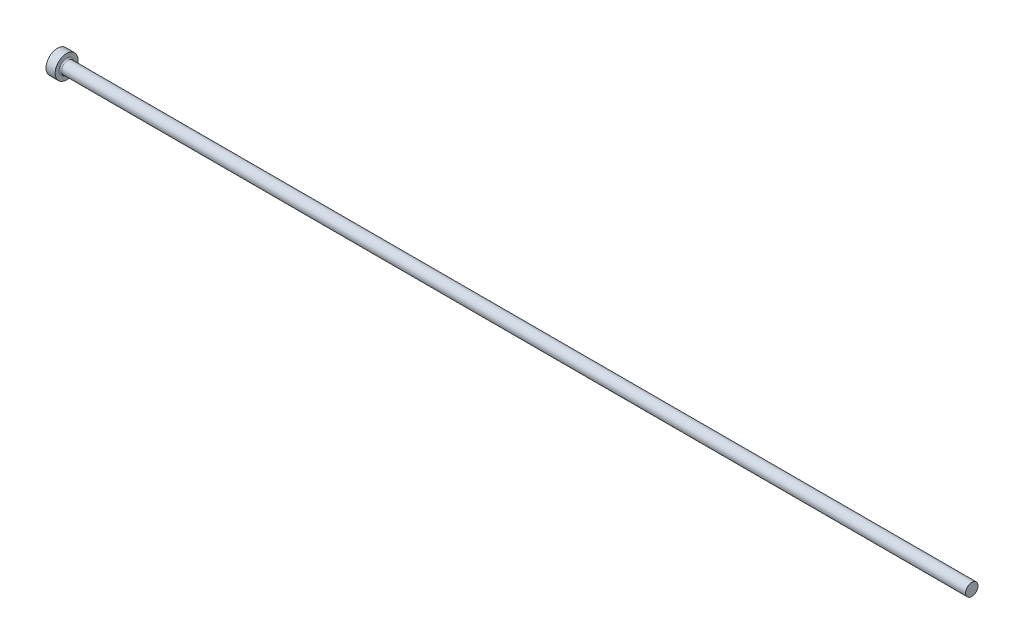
ISO-10303-21;
HEADER;
FILE_DESCRIPTION(('STEP AP214'),'2;1');
FILE_NAME('part.step','',(''),(''),'','','');
FILE_SCHEMA(('AUTOMOTIVE_DESIGN { 1 0 10303 214 1 1 1 1 }'));
ENDSEC;
DATA;
#1=APPLICATION_CONTEXT('core data for automotive mechanical design processes');
#2=APPLICATION_PROTOCOL_DEFINITION('international standard','automotive_design',2000,#1);
#3=PRODUCT_CONTEXT('',#1,'mechanical');
#4=PRODUCT('Part','Part','',(#3));
#5=PRODUCT_RELATED_PRODUCT_CATEGORY('part','',(#4));
#6=PRODUCT_DEFINITION_FORMATION('','',#4);
#7=PRODUCT_DEFINITION_CONTEXT('part definition',#1,'design');
#8=PRODUCT_DEFINITION('design','',#6,#7);
#9=PRODUCT_DEFINITION_SHAPE('','',#8);
#10=(LENGTH_UNIT() NAMED_UNIT(*) SI_UNIT(.MILLI.,.METRE.));
#11=(NAMED_UNIT(*) PLANE_ANGLE_UNIT() SI_UNIT($,.RADIAN.));
#12=(NAMED_UNIT(*) SI_UNIT($,.STERADIAN.) SOLID_ANGLE_UNIT());
#13=UNCERTAINTY_MEASURE_WITH_UNIT(LENGTH_MEASURE(1.E-05),#10,'distance_accuracy_value','');
#14=(GEOMETRIC_REPRESENTATION_CONTEXT(3) GLOBAL_UNCERTAINTY_ASSIGNED_CONTEXT((#13)) GLOBAL_UNIT_ASSIGNED_CONTEXT((#10,
#11,#12)) REPRESENTATION_CONTEXT('',''));
#15=CARTESIAN_POINT('',(0.,0.,0.));
#16=DIRECTION('',(0.,0.,1.));
#17=DIRECTION('',(1.,0.,0.));
#18=AXIS2_PLACEMENT_3D('',#15,#16,#17);
#19=CARTESIAN_POINT('',(0.,0.,0.));
#20=DIRECTION('',(-1.,0.,0.));
#21=DIRECTION('',(0.,-1.,0.));
#22=AXIS2_PLACEMENT_3D('',#19,#20,#21);
#23=PLANE('',#22);
#24=CARTESIAN_POINT('',(0.,0.,0.));
#25=DIRECTION('',(1.,0.,0.));
#26=DIRECTION('',(0.,1.,0.));
#27=AXIS2_PLACEMENT_3D('',#24,#25,#26);
#28=CIRCLE('',#27,2.5);
#29=CARTESIAN_POINT('',(0.,2.5,0.));
#30=VERTEX_POINT('',#29);
#31=EDGE_CURVE('E25',#30,#30,#28,.T.);
#32=ORIENTED_EDGE('',*,*,#31,.F.);
#33=EDGE_LOOP('',(#32));
#34=FACE_BOUND('',#33,.T.);
#35=ADVANCED_FACE('F14',(#34),#23,.T.);
#36=CARTESIAN_POINT('',(200.,0.,0.));
#37=DIRECTION('',(1.,0.,0.));
#38=DIRECTION('',(0.,1.,0.));
#39=AXIS2_PLACEMENT_3D('',#36,#37,#38);
#40=CYLINDRICAL_SURFACE('',#39,2.5);
#41=ORIENTED_EDGE('',*,*,#31,.T.);
#42=EDGE_LOOP('',(#41));
#43=FACE_BOUND('',#42,.T.);
#44=CARTESIAN_POINT('',(2.,0.,0.));
#45=DIRECTION('',(1.,0.,0.));
#46=DIRECTION('',(0.,1.,0.));
#47=AXIS2_PLACEMENT_3D('',#44,#45,#46);
#48=CIRCLE('',#47,2.5);
#49=CARTESIAN_POINT('',(2.,2.5,0.));
#50=VERTEX_POINT('',#49);
#51=EDGE_CURVE('E29',#50,#50,#48,.T.);
#52=ORIENTED_EDGE('',*,*,#51,.F.);
#53=EDGE_LOOP('',(#52));
#54=FACE_BOUND('',#53,.T.);
#55=ADVANCED_FACE('F51',(#43,#54),#40,.T.);
#56=CARTESIAN_POINT('',(2.,2.5,0.));
#57=DIRECTION('',(1.,0.,0.));
#58=DIRECTION('',(0.,1.,0.));
#59=AXIS2_PLACEMENT_3D('',#56,#57,#58);
#60=PLANE('',#59);
#61=CARTESIAN_POINT('',(2.,0.,0.));
#62=DIRECTION('',(1.,0.,0.));
#63=DIRECTION('',(0.,1.,0.));
#64=AXIS2_PLACEMENT_3D('',#61,#62,#63);
#65=CIRCLE('',#64,1.64999999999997);
#66=CARTESIAN_POINT('',(2.,1.64999999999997,0.));
#67=VERTEX_POINT('',#66);
#68=EDGE_CURVE('E9',#67,#67,#65,.F.);
#69=ORIENTED_EDGE('',*,*,#68,.T.);
#70=EDGE_LOOP('',(#69));
#71=FACE_BOUND('',#70,.T.);
#72=ORIENTED_EDGE('',*,*,#51,.T.);
#73=EDGE_LOOP('',(#72));
#74=FACE_BOUND('',#73,.T.);
#75=ADVANCED_FACE('F42',(#71,#74),#60,.T.);
#76=CARTESIAN_POINT('',(200.,0.,0.));
#77=DIRECTION('',(1.,0.,0.));
#78=DIRECTION('',(0.,1.,0.));
#79=AXIS2_PLACEMENT_3D('',#76,#77,#78);
#80=CYLINDRICAL_SURFACE('',#79,1.34999999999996);
#81=CARTESIAN_POINT('',(2.3,0.,0.));
#82=DIRECTION('',(1.,0.,0.));
#83=DIRECTION('',(0.,1.,0.));
#84=AXIS2_PLACEMENT_3D('',#81,#82,#83);
#85=CIRCLE('',#84,1.34999999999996);
#86=CARTESIAN_POINT('',(2.3,1.34999999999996,0.));
#87=VERTEX_POINT('',#86);
#88=EDGE_CURVE('E21',#87,#87,#85,.T.);
#89=ORIENTED_EDGE('',*,*,#88,.T.);
#90=EDGE_LOOP('',(#89));
#91=FACE_BOUND('',#90,.T.);
#92=CARTESIAN_POINT('',(200.,0.,0.));
#93=DIRECTION('',(1.,0.,0.));
#94=DIRECTION('',(0.,1.,0.));
#95=AXIS2_PLACEMENT_3D('',#92,#93,#94);
#96=CIRCLE('',#95,1.34999999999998);
#97=CARTESIAN_POINT('',(200.,1.34999999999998,0.));
#98=VERTEX_POINT('',#97);
#99=EDGE_CURVE('E34',#98,#98,#96,.T.);
#100=ORIENTED_EDGE('',*,*,#99,.F.);
#101=EDGE_LOOP('',(#100));
#102=FACE_BOUND('',#101,.T.);
#103=ADVANCED_FACE('F40',(#91,#102),#80,.T.);
#104=CARTESIAN_POINT('',(200.,1.34999999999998,0.));
#105=DIRECTION('',(1.,0.,0.));
#106=DIRECTION('',(0.,1.,0.));
#107=AXIS2_PLACEMENT_3D('',#104,#105,#106);
#108=PLANE('',#107);
#109=ORIENTED_EDGE('',*,*,#99,.T.);
#110=EDGE_LOOP('',(#109));
#111=FACE_BOUND('',#110,.T.);
#112=ADVANCED_FACE('F38',(#111),#108,.T.);
#113=CARTESIAN_POINT('',(2.3,0.,0.));
#114=DIRECTION('',(1.,0.,0.));
#115=DIRECTION('',(0.,1.,0.));
#116=AXIS2_PLACEMENT_3D('',#113,#114,#115);
#117=TOROIDAL_SURFACE('',#116,1.64999999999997,0.3);
#118=ORIENTED_EDGE('',*,*,#68,.F.);
#119=EDGE_LOOP('',(#118));
#120=FACE_BOUND('',#119,.T.);
#121=ORIENTED_EDGE('',*,*,#88,.F.);
#122=EDGE_LOOP('',(#121));
#123=FACE_BOUND('',#122,.T.);
#124=ADVANCED_FACE('F16',(#120,#123),#117,.F.);
#125=CLOSED_SHELL('',(#35,#55,#75,#103,#112,#124));
#126=MANIFOLD_SOLID_BREP('B1',#125);
#127=ADVANCED_BREP_SHAPE_REPRESENTATION('',(#18,#126),#14);
#128=SHAPE_DEFINITION_REPRESENTATION(#9,#127);
ENDSEC;
END-ISO-10303-21;
